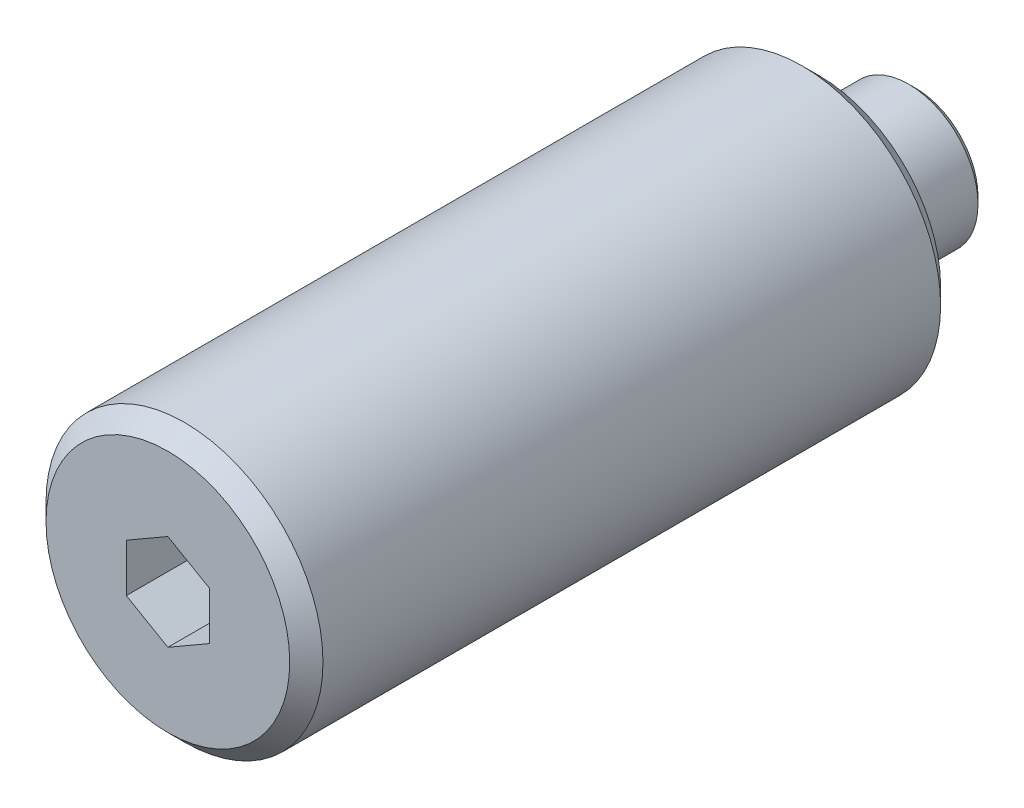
ISO-10303-21;
HEADER;
FILE_DESCRIPTION(('STEP AP214'),'2;1');
FILE_NAME('part.step','',(''),(''),'','','');
FILE_SCHEMA(('AUTOMOTIVE_DESIGN { 1 0 10303 214 1 1 1 1 }'));
ENDSEC;
DATA;
#1=APPLICATION_CONTEXT('core data for automotive mechanical design processes');
#2=APPLICATION_PROTOCOL_DEFINITION('international standard','automotive_design',2000,#1);
#3=PRODUCT_CONTEXT('',#1,'mechanical');
#4=PRODUCT('Part','Part','',(#3));
#5=PRODUCT_RELATED_PRODUCT_CATEGORY('part','',(#4));
#6=PRODUCT_DEFINITION_FORMATION('','',#4);
#7=PRODUCT_DEFINITION_CONTEXT('part definition',#1,'design');
#8=PRODUCT_DEFINITION('design','',#6,#7);
#9=PRODUCT_DEFINITION_SHAPE('','',#8);
#10=(LENGTH_UNIT() NAMED_UNIT(*) SI_UNIT(.MILLI.,.METRE.));
#11=(NAMED_UNIT(*) PLANE_ANGLE_UNIT() SI_UNIT($,.RADIAN.));
#12=(NAMED_UNIT(*) SI_UNIT($,.STERADIAN.) SOLID_ANGLE_UNIT());
#13=UNCERTAINTY_MEASURE_WITH_UNIT(LENGTH_MEASURE(1.E-05),#10,'distance_accuracy_value','');
#14=(GEOMETRIC_REPRESENTATION_CONTEXT(3) GLOBAL_UNCERTAINTY_ASSIGNED_CONTEXT((#13)) GLOBAL_UNIT_ASSIGNED_CONTEXT((#10,
#11,#12)) REPRESENTATION_CONTEXT('',''));
#15=CARTESIAN_POINT('',(0.,0.,0.));
#16=DIRECTION('',(0.,0.,1.));
#17=DIRECTION('',(1.,0.,0.));
#18=AXIS2_PLACEMENT_3D('',#15,#16,#17);
#19=CARTESIAN_POINT('',(0.,10.,54.));
#20=DIRECTION('',(0.,0.,1.));
#21=DIRECTION('',(1.,0.,0.));
#22=AXIS2_PLACEMENT_3D('',#19,#20,#21);
#23=PLANE('',#22);
#24=CARTESIAN_POINT('',(0.,0.,54.));
#25=DIRECTION('',(0.,0.,1.));
#26=DIRECTION('',(1.,0.,0.));
#27=AXIS2_PLACEMENT_3D('',#24,#25,#26);
#28=CIRCLE('',#27,8.8);
#29=CARTESIAN_POINT('',(8.8,0.,54.));
#30=VERTEX_POINT('',#29);
#31=EDGE_CURVE('E133',#30,#30,#28,.T.);
#32=ORIENTED_EDGE('',*,*,#31,.T.);
#33=EDGE_LOOP('',(#32));
#34=FACE_BOUND('',#33,.T.);
#35=DIRECTION('',(-0.866025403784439,0.5,0.));
#36=VECTOR('',#35,1.);
#37=CARTESIAN_POINT('',(3.,1.73205080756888,54.));
#38=LINE('',#37,#36);
#39=CARTESIAN_POINT('',(3.,1.73205080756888,54.));
#40=VERTEX_POINT('',#39);
#41=CARTESIAN_POINT('',(0.,3.46410161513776,54.));
#42=VERTEX_POINT('',#41);
#43=EDGE_CURVE('E29',#40,#42,#38,.T.);
#44=ORIENTED_EDGE('',*,*,#43,.F.);
#45=DIRECTION('',(0.,1.,0.));
#46=VECTOR('',#45,1.);
#47=CARTESIAN_POINT('',(3.,-1.73205080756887,54.));
#48=LINE('',#47,#46);
#49=CARTESIAN_POINT('',(3.,-1.73205080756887,54.));
#50=VERTEX_POINT('',#49);
#51=EDGE_CURVE('E112',#50,#40,#48,.T.);
#52=ORIENTED_EDGE('',*,*,#51,.F.);
#53=DIRECTION('',(0.866025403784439,0.5,0.));
#54=VECTOR('',#53,1.);
#55=CARTESIAN_POINT('',(0.,-3.46410161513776,54.));
#56=LINE('',#55,#54);
#57=CARTESIAN_POINT('',(0.,-3.46410161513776,54.));
#58=VERTEX_POINT('',#57);
#59=EDGE_CURVE('E110',#58,#50,#56,.T.);
#60=ORIENTED_EDGE('',*,*,#59,.F.);
#61=DIRECTION('',(0.866025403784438,-0.5,0.));
#62=VECTOR('',#61,1.);
#63=CARTESIAN_POINT('',(-3.,-1.73205080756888,54.));
#64=LINE('',#63,#62);
#65=CARTESIAN_POINT('',(-3.,-1.73205080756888,54.));
#66=VERTEX_POINT('',#65);
#67=EDGE_CURVE('E77',#66,#58,#64,.T.);
#68=ORIENTED_EDGE('',*,*,#67,.F.);
#69=DIRECTION('',(0.,-1.,0.));
#70=VECTOR('',#69,1.);
#71=CARTESIAN_POINT('',(-3.,1.73205080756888,54.));
#72=LINE('',#71,#70);
#73=CARTESIAN_POINT('',(-3.,1.73205080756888,54.));
#74=VERTEX_POINT('',#73);
#75=EDGE_CURVE('E106',#74,#66,#72,.T.);
#76=ORIENTED_EDGE('',*,*,#75,.F.);
#77=DIRECTION('',(-0.866025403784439,-0.5,0.));
#78=VECTOR('',#77,1.);
#79=CARTESIAN_POINT('',(0.,3.46410161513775,54.));
#80=LINE('',#79,#78);
#81=EDGE_CURVE('E103',#42,#74,#80,.T.);
#82=ORIENTED_EDGE('',*,*,#81,.F.);
#83=EDGE_LOOP('',(#44,#52,#60,#68,#76,#82));
#84=FACE_BOUND('',#83,.T.);
#85=ADVANCED_FACE('F14',(#34,#84),#23,.T.);
#86=CARTESIAN_POINT('',(0.,0.,-96.));
#87=DIRECTION('',(0.,0.,-1.));
#88=DIRECTION('',(-1.,0.,0.));
#89=AXIS2_PLACEMENT_3D('',#86,#87,#88);
#90=CYLINDRICAL_SURFACE('',#89,5.);
#91=CARTESIAN_POINT('',(0.,0.,0.500000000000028));
#92=DIRECTION('',(0.,0.,1.));
#93=DIRECTION('',(1.,0.,0.));
#94=AXIS2_PLACEMENT_3D('',#91,#92,#93);
#95=CIRCLE('',#94,5.);
#96=CARTESIAN_POINT('',(5.,0.,0.500000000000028));
#97=VERTEX_POINT('',#96);
#98=EDGE_CURVE('E9',#97,#97,#95,.T.);
#99=ORIENTED_EDGE('',*,*,#98,.T.);
#100=EDGE_LOOP('',(#99));
#101=FACE_BOUND('',#100,.T.);
#102=CARTESIAN_POINT('',(0.,0.,7.));
#103=DIRECTION('',(0.,0.,-1.));
#104=DIRECTION('',(-1.,0.,0.));
#105=AXIS2_PLACEMENT_3D('',#102,#103,#104);
#106=CIRCLE('',#105,5.);
#107=CARTESIAN_POINT('',(-5.,0.,7.));
#108=VERTEX_POINT('',#107);
#109=EDGE_CURVE('E116',#108,#108,#106,.T.);
#110=ORIENTED_EDGE('',*,*,#109,.T.);
#111=EDGE_LOOP('',(#110));
#112=FACE_BOUND('',#111,.T.);
#113=ADVANCED_FACE('F152',(#101,#112),#90,.T.);
#114=CARTESIAN_POINT('',(0.,5.,7.));
#115=DIRECTION('',(0.,0.,-1.));
#116=DIRECTION('',(-1.,0.,0.));
#117=AXIS2_PLACEMENT_3D('',#114,#115,#116);
#118=PLANE('',#117);
#119=CARTESIAN_POINT('',(0.,0.,7.));
#120=DIRECTION('',(0.,0.,-1.));
#121=DIRECTION('',(-1.,0.,0.));
#122=AXIS2_PLACEMENT_3D('',#119,#120,#121);
#123=CIRCLE('',#122,8.8);
#124=CARTESIAN_POINT('',(-8.8,0.,7.));
#125=VERTEX_POINT('',#124);
#126=EDGE_CURVE('E124',#125,#125,#123,.T.);
#127=ORIENTED_EDGE('',*,*,#126,.T.);
#128=EDGE_LOOP('',(#127));
#129=FACE_BOUND('',#128,.T.);
#130=ORIENTED_EDGE('',*,*,#109,.F.);
#131=EDGE_LOOP('',(#130));
#132=FACE_BOUND('',#131,.T.);
#133=ADVANCED_FACE('F159',(#129,#132),#118,.T.);
#134=CARTESIAN_POINT('',(0.,0.,-96.));
#135=DIRECTION('',(0.,0.,-1.));
#136=DIRECTION('',(-1.,0.,0.));
#137=AXIS2_PLACEMENT_3D('',#134,#135,#136);
#138=CYLINDRICAL_SURFACE('',#137,10.);
#139=CARTESIAN_POINT('',(0.,0.,8.2));
#140=DIRECTION('',(0.,0.,-1.));
#141=DIRECTION('',(-1.,0.,0.));
#142=AXIS2_PLACEMENT_3D('',#139,#140,#141);
#143=CIRCLE('',#142,10.);
#144=CARTESIAN_POINT('',(-10.,0.,8.2));
#145=VERTEX_POINT('',#144);
#146=EDGE_CURVE('E130',#145,#145,#143,.F.);
#147=ORIENTED_EDGE('',*,*,#146,.T.);
#148=EDGE_LOOP('',(#147));
#149=FACE_BOUND('',#148,.T.);
#150=CARTESIAN_POINT('',(0.,0.,52.8));
#151=DIRECTION('',(0.,0.,1.));
#152=DIRECTION('',(1.,0.,0.));
#153=AXIS2_PLACEMENT_3D('',#150,#151,#152);
#154=CIRCLE('',#153,10.);
#155=CARTESIAN_POINT('',(10.,0.,52.8));
#156=VERTEX_POINT('',#155);
#157=EDGE_CURVE('E127',#156,#156,#154,.F.);
#158=ORIENTED_EDGE('',*,*,#157,.T.);
#159=EDGE_LOOP('',(#158));
#160=FACE_BOUND('',#159,.T.);
#161=ADVANCED_FACE('F166',(#149,#160),#138,.T.);
#162=CARTESIAN_POINT('',(0.,5.,0.));
#163=DIRECTION('',(0.,0.,1.));
#164=DIRECTION('',(1.,0.,0.));
#165=AXIS2_PLACEMENT_3D('',#162,#163,#164);
#166=PLANE('',#165);
#167=CARTESIAN_POINT('',(0.,0.,0.));
#168=DIRECTION('',(0.,0.,1.));
#169=DIRECTION('',(1.,0.,0.));
#170=AXIS2_PLACEMENT_3D('',#167,#168,#169);
#171=CIRCLE('',#170,4.5);
#172=CARTESIAN_POINT('',(4.5,0.,0.));
#173=VERTEX_POINT('',#172);
#174=EDGE_CURVE('E22',#173,#173,#171,.F.);
#175=ORIENTED_EDGE('',*,*,#174,.T.);
#176=EDGE_LOOP('',(#175));
#177=FACE_BOUND('',#176,.T.);
#178=ADVANCED_FACE('F138',(#177),#166,.F.);
#179=CARTESIAN_POINT('',(3.,1.73205080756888,49.));
#180=DIRECTION('',(0.5,0.866025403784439,0.));
#181=DIRECTION('',(-0.866025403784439,0.5,0.));
#182=AXIS2_PLACEMENT_3D('',#179,#180,#181);
#183=PLANE('',#182);
#184=ORIENTED_EDGE('',*,*,#43,.T.);
#185=DIRECTION('',(0.,0.,1.));
#186=VECTOR('',#185,1.);
#187=CARTESIAN_POINT('',(0.,3.46410161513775,49.));
#188=LINE('',#187,#186);
#189=CARTESIAN_POINT('',(0.,3.46410161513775,49.));
#190=VERTEX_POINT('',#189);
#191=EDGE_CURVE('E59',#190,#42,#188,.T.);
#192=ORIENTED_EDGE('',*,*,#191,.F.);
#193=DIRECTION('',(-0.866025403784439,0.5,0.));
#194=VECTOR('',#193,1.);
#195=CARTESIAN_POINT('',(3.,1.73205080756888,49.));
#196=LINE('',#195,#194);
#197=CARTESIAN_POINT('',(3.,1.73205080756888,49.));
#198=VERTEX_POINT('',#197);
#199=EDGE_CURVE('E114',#198,#190,#196,.T.);
#200=ORIENTED_EDGE('',*,*,#199,.F.);
#201=DIRECTION('',(0.,0.,1.));
#202=VECTOR('',#201,1.);
#203=CARTESIAN_POINT('',(3.,1.73205080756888,49.));
#204=LINE('',#203,#202);
#205=EDGE_CURVE('E37',#198,#40,#204,.T.);
#206=ORIENTED_EDGE('',*,*,#205,.T.);
#207=EDGE_LOOP('',(#184,#192,#200,#206));
#208=FACE_BOUND('',#207,.T.);
#209=ADVANCED_FACE('F201',(#208),#183,.F.);
#210=CARTESIAN_POINT('',(3.,-1.73205080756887,49.));
#211=DIRECTION('',(1.,0.,0.));
#212=DIRECTION('',(0.,0.,-1.));
#213=AXIS2_PLACEMENT_3D('',#210,#211,#212);
#214=PLANE('',#213);
#215=ORIENTED_EDGE('',*,*,#51,.T.);
#216=ORIENTED_EDGE('',*,*,#205,.F.);
#217=DIRECTION('',(0.,1.,0.));
#218=VECTOR('',#217,1.);
#219=CARTESIAN_POINT('',(3.,-1.73205080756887,49.));
#220=LINE('',#219,#218);
#221=CARTESIAN_POINT('',(3.,-1.73205080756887,49.));
#222=VERTEX_POINT('',#221);
#223=EDGE_CURVE('E89',#222,#198,#220,.T.);
#224=ORIENTED_EDGE('',*,*,#223,.F.);
#225=DIRECTION('',(0.,0.,1.));
#226=VECTOR('',#225,1.);
#227=CARTESIAN_POINT('',(3.,-1.73205080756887,49.));
#228=LINE('',#227,#226);
#229=EDGE_CURVE('E81',#222,#50,#228,.T.);
#230=ORIENTED_EDGE('',*,*,#229,.T.);
#231=EDGE_LOOP('',(#215,#216,#224,#230));
#232=FACE_BOUND('',#231,.T.);
#233=ADVANCED_FACE('F198',(#232),#214,.F.);
#234=CARTESIAN_POINT('',(0.,-3.46410161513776,49.));
#235=DIRECTION('',(0.5,-0.866025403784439,0.));
#236=DIRECTION('',(0.866025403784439,0.5,0.));
#237=AXIS2_PLACEMENT_3D('',#234,#235,#236);
#238=PLANE('',#237);
#239=ORIENTED_EDGE('',*,*,#59,.T.);
#240=ORIENTED_EDGE('',*,*,#229,.F.);
#241=DIRECTION('',(0.866025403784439,0.5,0.));
#242=VECTOR('',#241,1.);
#243=CARTESIAN_POINT('',(0.,-3.46410161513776,49.));
#244=LINE('',#243,#242);
#245=CARTESIAN_POINT('',(0.,-3.46410161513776,49.));
#246=VERTEX_POINT('',#245);
#247=EDGE_CURVE('E85',#246,#222,#244,.T.);
#248=ORIENTED_EDGE('',*,*,#247,.F.);
#249=DIRECTION('',(0.,0.,1.));
#250=VECTOR('',#249,1.);
#251=CARTESIAN_POINT('',(0.,-3.46410161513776,49.));
#252=LINE('',#251,#250);
#253=EDGE_CURVE('E70',#246,#58,#252,.T.);
#254=ORIENTED_EDGE('',*,*,#253,.T.);
#255=EDGE_LOOP('',(#239,#240,#248,#254));
#256=FACE_BOUND('',#255,.T.);
#257=ADVANCED_FACE('F86',(#256),#238,.F.);
#258=CARTESIAN_POINT('',(-3.,-1.73205080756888,49.));
#259=DIRECTION('',(-0.5,-0.866025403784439,0.));
#260=DIRECTION('',(0.866025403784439,-0.5,0.));
#261=AXIS2_PLACEMENT_3D('',#258,#259,#260);
#262=PLANE('',#261);
#263=ORIENTED_EDGE('',*,*,#67,.T.);
#264=ORIENTED_EDGE('',*,*,#253,.F.);
#265=DIRECTION('',(0.866025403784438,-0.5,0.));
#266=VECTOR('',#265,1.);
#267=CARTESIAN_POINT('',(-3.,-1.73205080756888,49.));
#268=LINE('',#267,#266);
#269=CARTESIAN_POINT('',(-3.,-1.73205080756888,49.));
#270=VERTEX_POINT('',#269);
#271=EDGE_CURVE('E74',#270,#246,#268,.T.);
#272=ORIENTED_EDGE('',*,*,#271,.F.);
#273=DIRECTION('',(0.,0.,1.));
#274=VECTOR('',#273,1.);
#275=CARTESIAN_POINT('',(-3.,-1.73205080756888,49.));
#276=LINE('',#275,#274);
#277=EDGE_CURVE('E82',#270,#66,#276,.T.);
#278=ORIENTED_EDGE('',*,*,#277,.T.);
#279=EDGE_LOOP('',(#263,#264,#272,#278));
#280=FACE_BOUND('',#279,.T.);
#281=ADVANCED_FACE('F72',(#280),#262,.F.);
#282=CARTESIAN_POINT('',(-3.,1.73205080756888,49.));
#283=DIRECTION('',(-1.,0.,0.));
#284=DIRECTION('',(0.,0.,1.));
#285=AXIS2_PLACEMENT_3D('',#282,#283,#284);
#286=PLANE('',#285);
#287=ORIENTED_EDGE('',*,*,#75,.T.);
#288=ORIENTED_EDGE('',*,*,#277,.F.);
#289=DIRECTION('',(0.,-1.,0.));
#290=VECTOR('',#289,1.);
#291=CARTESIAN_POINT('',(-3.,1.73205080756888,49.));
#292=LINE('',#291,#290);
#293=CARTESIAN_POINT('',(-3.,1.73205080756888,49.));
#294=VERTEX_POINT('',#293);
#295=EDGE_CURVE('E95',#294,#270,#292,.T.);
#296=ORIENTED_EDGE('',*,*,#295,.F.);
#297=DIRECTION('',(0.,0.,1.));
#298=VECTOR('',#297,1.);
#299=CARTESIAN_POINT('',(-3.,1.73205080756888,49.));
#300=LINE('',#299,#298);
#301=EDGE_CURVE('E119',#294,#74,#300,.T.);
#302=ORIENTED_EDGE('',*,*,#301,.T.);
#303=EDGE_LOOP('',(#287,#288,#296,#302));
#304=FACE_BOUND('',#303,.T.);
#305=ADVANCED_FACE('F194',(#304),#286,.F.);
#306=CARTESIAN_POINT('',(0.,3.46410161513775,49.));
#307=DIRECTION('',(-0.5,0.866025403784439,0.));
#308=DIRECTION('',(-0.866025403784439,-0.5,0.));
#309=AXIS2_PLACEMENT_3D('',#306,#307,#308);
#310=PLANE('',#309);
#311=ORIENTED_EDGE('',*,*,#81,.T.);
#312=ORIENTED_EDGE('',*,*,#301,.F.);
#313=DIRECTION('',(-0.866025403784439,-0.5,0.));
#314=VECTOR('',#313,1.);
#315=CARTESIAN_POINT('',(0.,3.46410161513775,49.));
#316=LINE('',#315,#314);
#317=EDGE_CURVE('E97',#190,#294,#316,.T.);
#318=ORIENTED_EDGE('',*,*,#317,.F.);
#319=ORIENTED_EDGE('',*,*,#191,.T.);
#320=EDGE_LOOP('',(#311,#312,#318,#319));
#321=FACE_BOUND('',#320,.T.);
#322=ADVANCED_FACE('F179',(#321),#310,.F.);
#323=CARTESIAN_POINT('',(0.,3.46410161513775,49.));
#324=DIRECTION('',(0.,0.,1.));
#325=DIRECTION('',(1.,0.,0.));
#326=AXIS2_PLACEMENT_3D('',#323,#324,#325);
#327=PLANE('',#326);
#328=ORIENTED_EDGE('',*,*,#199,.T.);
#329=ORIENTED_EDGE('',*,*,#317,.T.);
#330=ORIENTED_EDGE('',*,*,#295,.T.);
#331=ORIENTED_EDGE('',*,*,#271,.T.);
#332=ORIENTED_EDGE('',*,*,#247,.T.);
#333=ORIENTED_EDGE('',*,*,#223,.T.);
#334=EDGE_LOOP('',(#328,#329,#330,#331,#332,#333));
#335=FACE_BOUND('',#334,.T.);
#336=ADVANCED_FACE('F92',(#335),#327,.T.);
#337=CARTESIAN_POINT('',(0.,0.,7.));
#338=DIRECTION('',(0.,0.,1.));
#339=DIRECTION('',(1.,0.,0.));
#340=AXIS2_PLACEMENT_3D('',#337,#338,#339);
#341=CONICAL_SURFACE('',#340,8.8,0.78539816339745);
#342=ORIENTED_EDGE('',*,*,#146,.F.);
#343=EDGE_LOOP('',(#342));
#344=FACE_BOUND('',#343,.T.);
#345=ORIENTED_EDGE('',*,*,#126,.F.);
#346=EDGE_LOOP('',(#345));
#347=FACE_BOUND('',#346,.T.);
#348=ADVANCED_FACE('F148',(#344,#347),#341,.T.);
#349=CARTESIAN_POINT('',(0.,0.,52.8));
#350=DIRECTION('',(0.,0.,-1.));
#351=DIRECTION('',(-1.,0.,0.));
#352=AXIS2_PLACEMENT_3D('',#349,#350,#351);
#353=CONICAL_SURFACE('',#352,10.,0.785398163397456);
#354=ORIENTED_EDGE('',*,*,#31,.F.);
#355=EDGE_LOOP('',(#354));
#356=FACE_BOUND('',#355,.T.);
#357=ORIENTED_EDGE('',*,*,#157,.F.);
#358=EDGE_LOOP('',(#357));
#359=FACE_BOUND('',#358,.T.);
#360=ADVANCED_FACE('F141',(#356,#359),#353,.T.);
#361=CARTESIAN_POINT('',(0.,0.,0.));
#362=DIRECTION('',(0.,0.,1.));
#363=DIRECTION('',(1.,0.,0.));
#364=AXIS2_PLACEMENT_3D('',#361,#362,#363);
#365=CONICAL_SURFACE('',#364,4.5,0.785398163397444);
#366=ORIENTED_EDGE('',*,*,#98,.F.);
#367=EDGE_LOOP('',(#366));
#368=FACE_BOUND('',#367,.T.);
#369=ORIENTED_EDGE('',*,*,#174,.F.);
#370=EDGE_LOOP('',(#369));
#371=FACE_BOUND('',#370,.T.);
#372=ADVANCED_FACE('F16',(#368,#371),#365,.T.);
#373=CLOSED_SHELL('',(#85,#113,#133,#161,#178,#209,#233,#257,#281,#305,#322,#336,#348,#360,#372));
#374=MANIFOLD_SOLID_BREP('B1',#373);
#375=ADVANCED_BREP_SHAPE_REPRESENTATION('',(#18,#374),#14);
#376=SHAPE_DEFINITION_REPRESENTATION(#9,#375);
ENDSEC;
END-ISO-10303-21;
